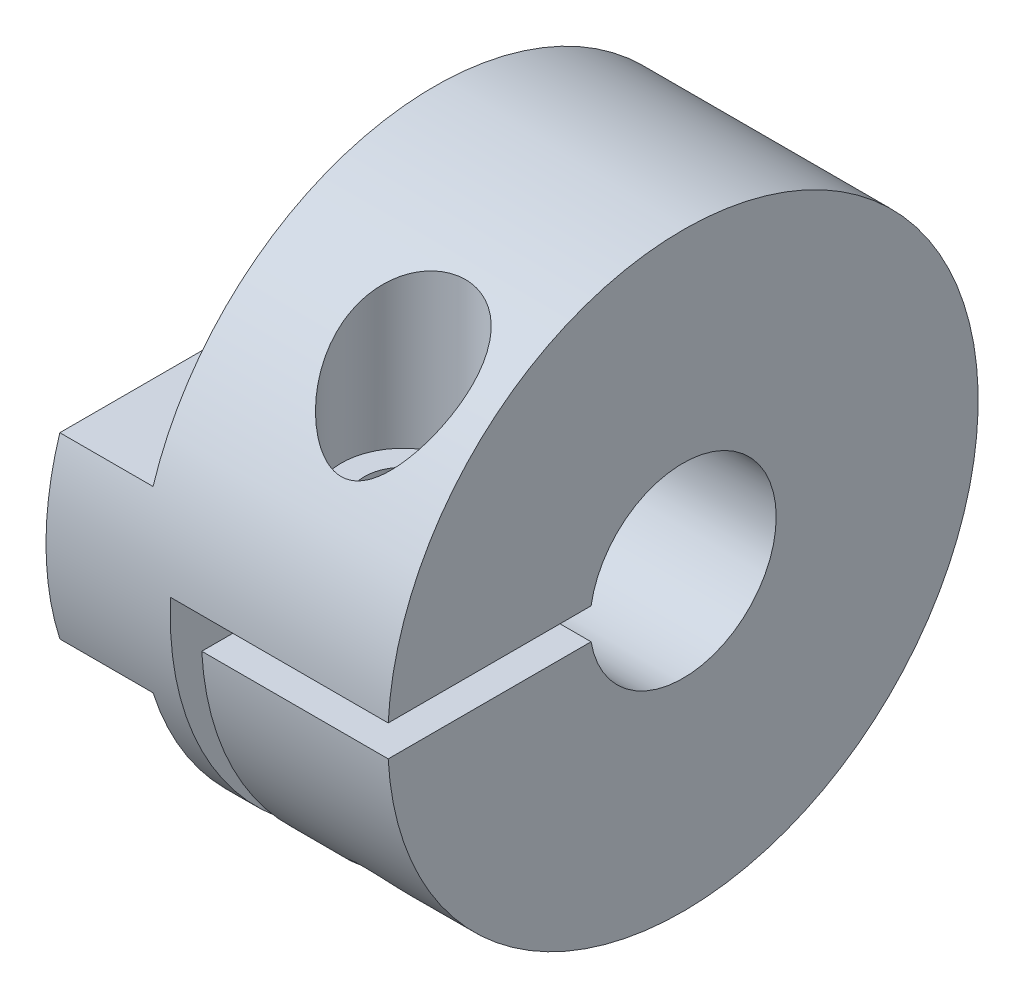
from build123d import *

# Parameters (mm, degrees)
ESQUISSE2_W                  = 3
ESQUISSE2_H                  = 6.625
ENL_V_MAT_EXTRU_1_DEPTH      = 10
ESQUISSE3_W                  = 1
ESQUISSE3_H                  = 19
ENL_V_MAT_EXTRU_2_DEPTH      = 18.363755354
ESQUISSE4_W                  = 9.5
ESQUISSE4_H                  = 1
ENL_V_MAT_EXTRU_3_DEPTH      = 7
ESQUISSE5_R                  = 1.25
ENL_V_MAT_EXTRU_4_DEPTH      = 10
ENL_V_MAT_EXTRU_6_REACH      = 21.5
ENL_V_MAT_EXTRU_6_END_RADIUS = 9.5
ESQUISSE7_R                  = 2


with BuildPart() as part:
    # Esquisse1 → Base-R_volution (revolve)
    with BuildSketch(Plane.XY, mode=Mode.PRIVATE) as base_r_volution_sk:
        Polygon((0, 1.5), (0, 9.5), (11, 9.5), (11, 3), (4, 3), (4, 1.5), align=None)
    revolve(base_r_volution_sk.sketch.rotate(Axis((0, 0, 0), (1, 0, 0)), 90), axis=Axis((0, 0, 0), (1, 0, 0)))

    # Esquisse2 → Enl_v. mat.-Extru.1 (cut, symmetric)
    with BuildSketch(Plane.XY):
        with Locations((1.5, 6.1875)):
            Rectangle(ESQUISSE2_W, ESQUISSE2_H)
        with Locations((1.5, -6.1875)):
            Rectangle(ESQUISSE2_W, ESQUISSE2_H)
    extrude(amount=ENL_V_MAT_EXTRU_1_DEPTH, both=True, mode=Mode.SUBTRACT)

    # Esquisse3 → Enl_v. mat.-Extru.2 (cut, through all)
    with BuildSketch(Plane(origin=(0, 0, 0), x_dir=(1, 0, 0), z_dir=(0, 1, 0))):
        with Locations((4.5, 0)):
            Rectangle(ESQUISSE3_W, ESQUISSE3_H)
    extrude(amount=-ENL_V_MAT_EXTRU_2_DEPTH, mode=Mode.SUBTRACT)

    # Esquisse4 → Enl_v. mat.-Extru.3 (cut)
    with BuildSketch(Plane(origin=(11, 0, 0), x_dir=(0, 0, -1), z_dir=(1, 0, 0))):
        with Locations((-4.75, 0)):
            Rectangle(ESQUISSE4_W, ESQUISSE4_H)
    extrude(amount=-ENL_V_MAT_EXTRU_3_DEPTH, mode=Mode.SUBTRACT)

    # Esquisse5 → Enl_v. mat.-Extru.4 (cut, symmetric)
    with BuildSketch(Plane(origin=(0, 0, 0), x_dir=(1, 0, 0), z_dir=(0, 1, 0))):
        with Locations(Location((8, -6, 0), (0, 0, 270))):
            Circle(ESQUISSE5_R)
    extrude(amount=ENL_V_MAT_EXTRU_4_DEPTH, both=True, mode=Mode.SUBTRACT)

    # Enl_v. mat.-Extru.6: up to this cylinder (the profile starts inside it)
    enl_v_mat_extru_6_end = Plane(origin=(8, 0, 0), z_dir=(-1, 0, 0)) * Cylinder(ENL_V_MAT_EXTRU_6_END_RADIUS, 63, mode=Mode.PRIVATE)
    # Esquisse7 → Enl_v. mat.-Extru.6 (cut, up to the surface)
    with BuildSketch(Plane.XZ.offset(-3.5), mode=Mode.PRIVATE) as enl_v_mat_extru_6_sk1:
        with Locations(Location((8, 6, 0), (0, 0, 270))):
            Circle(ESQUISSE7_R)
    enl_v_mat_extru_6_tool1 = extrude(enl_v_mat_extru_6_sk1.sketch, amount=-ENL_V_MAT_EXTRU_6_REACH, mode=Mode.PRIVATE) & enl_v_mat_extru_6_end
    add(enl_v_mat_extru_6_tool1.solids().sort_by_distance((8, 3.5, 6))[0], mode=Mode.SUBTRACT)


solid = part.part
